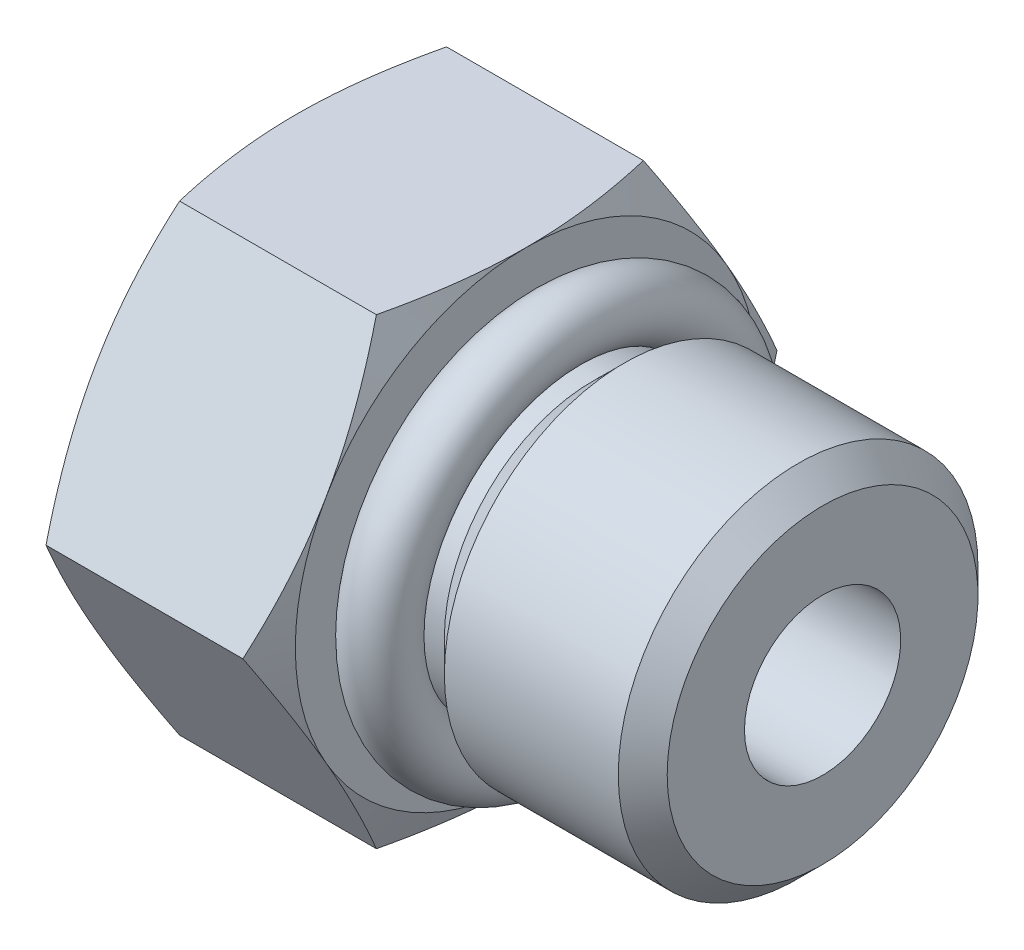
ISO-10303-21;
HEADER;
FILE_DESCRIPTION(('STEP AP214'),'2;1');
FILE_NAME('part.step','',(''),(''),'','','');
FILE_SCHEMA(('AUTOMOTIVE_DESIGN { 1 0 10303 214 1 1 1 1 }'));
ENDSEC;
DATA;
#1=APPLICATION_CONTEXT('core data for automotive mechanical design processes');
#2=APPLICATION_PROTOCOL_DEFINITION('international standard','automotive_design',2000,#1);
#3=PRODUCT_CONTEXT('',#1,'mechanical');
#4=PRODUCT('Part','Part','',(#3));
#5=PRODUCT_RELATED_PRODUCT_CATEGORY('part','',(#4));
#6=PRODUCT_DEFINITION_FORMATION('','',#4);
#7=PRODUCT_DEFINITION_CONTEXT('part definition',#1,'design');
#8=PRODUCT_DEFINITION('design','',#6,#7);
#9=PRODUCT_DEFINITION_SHAPE('','',#8);
#10=(LENGTH_UNIT() NAMED_UNIT(*) SI_UNIT(.MILLI.,.METRE.));
#11=(NAMED_UNIT(*) PLANE_ANGLE_UNIT() SI_UNIT($,.RADIAN.));
#12=(NAMED_UNIT(*) SI_UNIT($,.STERADIAN.) SOLID_ANGLE_UNIT());
#13=UNCERTAINTY_MEASURE_WITH_UNIT(LENGTH_MEASURE(1.E-05),#10,'distance_accuracy_value','');
#14=(GEOMETRIC_REPRESENTATION_CONTEXT(3) GLOBAL_UNCERTAINTY_ASSIGNED_CONTEXT((#13)) GLOBAL_UNIT_ASSIGNED_CONTEXT((#10,
#11,#12)) REPRESENTATION_CONTEXT('',''));
#15=CARTESIAN_POINT('',(0.,0.,0.));
#16=DIRECTION('',(0.,0.,1.));
#17=DIRECTION('',(1.,0.,0.));
#18=AXIS2_PLACEMENT_3D('',#15,#16,#17);
#19=CARTESIAN_POINT('',(-12.7,0.,0.));
#20=DIRECTION('',(-1.,0.,0.));
#21=DIRECTION('',(0.,0.,1.));
#22=AXIS2_PLACEMENT_3D('',#19,#20,#21);
#23=CYLINDRICAL_SURFACE('',#22,2.413);
#24=CARTESIAN_POINT('',(-6.53640795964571,0.,0.));
#25=DIRECTION('',(-1.,0.,0.));
#26=DIRECTION('',(0.,0.,1.));
#27=AXIS2_PLACEMENT_3D('',#24,#25,#26);
#28=CIRCLE('',#27,2.413);
#29=CARTESIAN_POINT('',(-6.53640795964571,0.,2.413));
#30=VERTEX_POINT('',#29);
#31=EDGE_CURVE('E44',#30,#30,#28,.T.);
#32=ORIENTED_EDGE('',*,*,#31,.T.);
#33=EDGE_LOOP('',(#32));
#34=FACE_BOUND('',#33,.T.);
#35=CARTESIAN_POINT('',(0.,0.,0.));
#36=DIRECTION('',(-1.,0.,0.));
#37=DIRECTION('',(0.,0.,1.));
#38=AXIS2_PLACEMENT_3D('',#35,#36,#37);
#39=CIRCLE('',#38,2.413);
#40=CARTESIAN_POINT('',(0.,0.,2.413));
#41=VERTEX_POINT('',#40);
#42=EDGE_CURVE('E306',#41,#41,#39,.T.);
#43=ORIENTED_EDGE('',*,*,#42,.F.);
#44=EDGE_LOOP('',(#43));
#45=FACE_BOUND('',#44,.T.);
#46=ADVANCED_FACE('F40',(#34,#45),#23,.F.);
#47=CARTESIAN_POINT('',(-16.256,0.,0.));
#48=DIRECTION('',(1.,0.,0.));
#49=DIRECTION('',(0.,1.,0.));
#50=AXIS2_PLACEMENT_3D('',#47,#48,#49);
#51=PLANE('',#50);
#52=CARTESIAN_POINT('',(-16.256,0.,0.));
#53=DIRECTION('',(-1.,0.,0.));
#54=DIRECTION('',(0.,0.,1.));
#55=AXIS2_PLACEMENT_3D('',#52,#53,#54);
#56=CIRCLE('',#55,4.7275369);
#57=CARTESIAN_POINT('',(-16.256,0.,4.7275369));
#58=VERTEX_POINT('',#57);
#59=EDGE_CURVE('E727',#58,#58,#56,.T.);
#60=ORIENTED_EDGE('',*,*,#59,.F.);
#61=EDGE_LOOP('',(#60));
#62=FACE_BOUND('',#61,.T.);
#63=CARTESIAN_POINT('',(-16.256,0.,0.));
#64=DIRECTION('',(1.,0.,0.));
#65=DIRECTION('',(0.,1.,0.));
#66=AXIS2_PLACEMENT_3D('',#63,#64,#65);
#67=CIRCLE('',#66,7.14375);
#68=CARTESIAN_POINT('',(-16.256,3.571875,6.18666897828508));
#69=VERTEX_POINT('',#68);
#70=CARTESIAN_POINT('',(-16.256,7.14375,0.));
#71=VERTEX_POINT('',#70);
#72=EDGE_CURVE('E132',#69,#71,#67,.F.);
#73=ORIENTED_EDGE('',*,*,#72,.T.);
#74=CARTESIAN_POINT('',(-16.256,0.,0.));
#75=DIRECTION('',(1.,0.,0.));
#76=DIRECTION('',(0.,1.,0.));
#77=AXIS2_PLACEMENT_3D('',#74,#75,#76);
#78=CIRCLE('',#77,7.14375);
#79=CARTESIAN_POINT('',(-16.256,3.571875,-6.18666897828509));
#80=VERTEX_POINT('',#79);
#81=EDGE_CURVE('E127',#71,#80,#78,.F.);
#82=ORIENTED_EDGE('',*,*,#81,.T.);
#83=CARTESIAN_POINT('',(-16.256,0.,0.));
#84=DIRECTION('',(1.,0.,0.));
#85=DIRECTION('',(0.,1.,0.));
#86=AXIS2_PLACEMENT_3D('',#83,#84,#85);
#87=CIRCLE('',#86,7.14375);
#88=CARTESIAN_POINT('',(-16.256,-3.57187500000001,-6.18666897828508));
#89=VERTEX_POINT('',#88);
#90=EDGE_CURVE('E129',#80,#89,#87,.F.);
#91=ORIENTED_EDGE('',*,*,#90,.T.);
#92=CARTESIAN_POINT('',(-16.256,0.,0.));
#93=DIRECTION('',(1.,0.,0.));
#94=DIRECTION('',(0.,1.,0.));
#95=AXIS2_PLACEMENT_3D('',#92,#93,#94);
#96=CIRCLE('',#95,7.14375);
#97=CARTESIAN_POINT('',(-16.256,-7.14375,0.));
#98=VERTEX_POINT('',#97);
#99=EDGE_CURVE('E313',#89,#98,#96,.F.);
#100=ORIENTED_EDGE('',*,*,#99,.T.);
#101=CARTESIAN_POINT('',(-16.256,0.,0.));
#102=DIRECTION('',(1.,0.,0.));
#103=DIRECTION('',(0.,1.,0.));
#104=AXIS2_PLACEMENT_3D('',#101,#102,#103);
#105=CIRCLE('',#104,7.14375);
#106=CARTESIAN_POINT('',(-16.256,-3.571875,6.18666897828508));
#107=VERTEX_POINT('',#106);
#108=EDGE_CURVE('E309',#98,#107,#105,.F.);
#109=ORIENTED_EDGE('',*,*,#108,.T.);
#110=CARTESIAN_POINT('',(-16.256,0.,0.));
#111=DIRECTION('',(1.,0.,0.));
#112=DIRECTION('',(0.,1.,0.));
#113=AXIS2_PLACEMENT_3D('',#110,#111,#112);
#114=CIRCLE('',#113,7.14375);
#115=EDGE_CURVE('E311',#107,#69,#114,.F.);
#116=ORIENTED_EDGE('',*,*,#115,.T.);
#117=EDGE_LOOP('',(#73,#82,#91,#100,#109,#116));
#118=FACE_BOUND('',#117,.T.);
#119=ADVANCED_FACE('F42',(#62,#118),#51,.F.);
#120=CARTESIAN_POINT('',(-16.256,0.,0.));
#121=DIRECTION('',(1.,0.,0.));
#122=DIRECTION('',(0.,1.,0.));
#123=AXIS2_PLACEMENT_3D('',#120,#121,#122);
#124=CONICAL_SURFACE('',#123,7.14375,1.13446401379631);
#125=ORIENTED_EDGE('',*,*,#90,.F.);
#126=CARTESIAN_POINT('',(-15.7406638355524,0.,-8.24889197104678));
#127=CARTESIAN_POINT('',(-15.8195905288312,0.293058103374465,-8.07969479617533));
#128=CARTESIAN_POINT('',(-15.8916199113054,0.58769517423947,-7.90958600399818));
#129=CARTESIAN_POINT('',(-16.0184120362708,1.17869518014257,-7.56837199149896));
#130=CARTESIAN_POINT('',(-16.0732320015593,1.47504898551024,-7.39727204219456));
#131=CARTESIAN_POINT('',(-16.1403575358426,1.92140845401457,-7.13956628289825));
#132=CARTESIAN_POINT('',(-16.1602205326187,2.0705634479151,-7.0534516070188));
#133=CARTESIAN_POINT('',(-16.1945639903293,2.36933901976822,-6.88095345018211));
#134=CARTESIAN_POINT('',(-16.2090445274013,2.51895959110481,-6.79456997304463));
#135=CARTESIAN_POINT('',(-16.2323806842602,2.81903318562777,-6.6213224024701));
#136=CARTESIAN_POINT('',(-16.2412173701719,2.96948732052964,-6.53445766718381));
#137=CARTESIAN_POINT('',(-16.2530376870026,3.27058454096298,-6.36061910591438));
#138=CARTESIAN_POINT('',(-16.2560206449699,3.42122764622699,-6.27364526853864));
#139=CARTESIAN_POINT('',(-16.256,3.571875,-6.18666897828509));
#140=B_SPLINE_CURVE_WITH_KNOTS('',3,(#126,#127,#128,#129,#130,#131,#132,#133,#134,#135,#136,
#137,#138,#139),.UNSPECIFIED.,.F.,.F.,(4,2,2,2,2,2,4),(0.,1.04269338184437,2.08188206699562,
2.60191814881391,3.12194687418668,3.64371114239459,4.16553538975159),.UNSPECIFIED.);
#141=CARTESIAN_POINT('',(-15.7406638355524,0.,-8.24889197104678));
#142=VERTEX_POINT('',#141);
#143=EDGE_CURVE('E143',#142,#80,#140,.T.);
#144=ORIENTED_EDGE('',*,*,#143,.F.);
#145=CARTESIAN_POINT('',(-16.256,-3.57187500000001,-6.18666897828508));
#146=CARTESIAN_POINT('',(-16.25602064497,-3.421227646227,-6.27364526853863));
#147=CARTESIAN_POINT('',(-16.2530376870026,-3.27058454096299,-6.36061910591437));
#148=CARTESIAN_POINT('',(-16.2412173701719,-2.96948732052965,-6.53445766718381));
#149=CARTESIAN_POINT('',(-16.2323806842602,-2.81903318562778,-6.62132240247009));
#150=CARTESIAN_POINT('',(-16.2090445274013,-2.51895959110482,-6.79456997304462));
#151=CARTESIAN_POINT('',(-16.1945639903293,-2.36933901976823,-6.88095345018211));
#152=CARTESIAN_POINT('',(-16.1602205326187,-2.07056344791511,-7.05345160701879));
#153=CARTESIAN_POINT('',(-16.1403575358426,-1.92140845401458,-7.13956628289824));
#154=CARTESIAN_POINT('',(-16.0732320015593,-1.47504898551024,-7.39727204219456));
#155=CARTESIAN_POINT('',(-16.0184120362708,-1.17869518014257,-7.56837199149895));
#156=CARTESIAN_POINT('',(-15.8916199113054,-0.587695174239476,-7.90958600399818));
#157=CARTESIAN_POINT('',(-15.8195905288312,-0.293058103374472,-8.07969479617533));
#158=CARTESIAN_POINT('',(-15.7406638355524,0.,-8.24889197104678));
#159=B_SPLINE_CURVE_WITH_KNOTS('',3,(#145,#146,#147,#148,#149,#150,#151,#152,#153,#154,#155,
#156,#157,#158),.UNSPECIFIED.,.F.,.F.,(4,2,2,2,2,2,4),(0.,0.521824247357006,1.04358851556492,
1.56361724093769,2.08365332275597,3.12284200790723,4.1655353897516),.UNSPECIFIED.);
#160=EDGE_CURVE('E145',#89,#142,#159,.T.);
#161=ORIENTED_EDGE('',*,*,#160,.F.);
#162=EDGE_LOOP('',(#125,#144,#161));
#163=FACE_BOUND('',#162,.T.);
#164=ADVANCED_FACE('F141',(#163),#124,.T.);
#165=CARTESIAN_POINT('',(-16.256,0.,0.));
#166=DIRECTION('',(1.,0.,0.));
#167=DIRECTION('',(0.,1.,0.));
#168=AXIS2_PLACEMENT_3D('',#165,#166,#167);
#169=CONICAL_SURFACE('',#168,7.14375,1.13446401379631);
#170=ORIENTED_EDGE('',*,*,#81,.F.);
#171=CARTESIAN_POINT('',(-15.7406638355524,7.14375,-4.12444598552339));
#172=CARTESIAN_POINT('',(-15.8195905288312,7.14375,-3.78605163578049));
#173=CARTESIAN_POINT('',(-15.8916199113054,7.14375,-3.44583405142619));
#174=CARTESIAN_POINT('',(-16.0184120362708,7.14375,-2.76340602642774));
#175=CARTESIAN_POINT('',(-16.0732320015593,7.14375,-2.42120612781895));
#176=CARTESIAN_POINT('',(-16.1403575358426,7.14375,-1.90579460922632));
#177=CARTESIAN_POINT('',(-16.1602205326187,7.14375,-1.73356525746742));
#178=CARTESIAN_POINT('',(-16.1945639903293,7.14375,-1.38856894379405));
#179=CARTESIAN_POINT('',(-16.2090445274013,7.14375,-1.21580198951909));
#180=CARTESIAN_POINT('',(-16.2323806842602,7.14375,-0.869306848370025));
#181=CARTESIAN_POINT('',(-16.2412173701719,7.14375,-0.695577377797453));
#182=CARTESIAN_POINT('',(-16.2530376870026,7.14375,-0.34790025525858));
#183=CARTESIAN_POINT('',(-16.25602064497,7.14375,-0.173952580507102));
#184=CARTESIAN_POINT('',(-16.256,7.14375,0.));
#185=B_SPLINE_CURVE_WITH_KNOTS('',3,(#171,#172,#173,#174,#175,#176,#177,#178,#179,#180,#181,
#182,#183,#184),.UNSPECIFIED.,.F.,.F.,(4,2,2,2,2,2,4),(0.,1.04269338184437,2.08188206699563,
2.60191814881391,3.12194687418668,3.64371114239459,4.1655353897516),.UNSPECIFIED.);
#186=CARTESIAN_POINT('',(-15.7406638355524,7.14375,-4.1244459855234));
#187=VERTEX_POINT('',#186);
#188=EDGE_CURVE('E150',#187,#71,#185,.T.);
#189=ORIENTED_EDGE('',*,*,#188,.F.);
#190=CARTESIAN_POINT('',(-16.256,3.571875,-6.18666897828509));
#191=CARTESIAN_POINT('',(-16.2560206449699,3.72252235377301,-6.09969268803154));
#192=CARTESIAN_POINT('',(-16.2530376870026,3.87316545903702,-6.0127188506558));
#193=CARTESIAN_POINT('',(-16.2412173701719,4.17426267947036,-5.83888028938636));
#194=CARTESIAN_POINT('',(-16.2323806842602,4.32471681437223,-5.75201555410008));
#195=CARTESIAN_POINT('',(-16.2090445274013,4.62479040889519,-5.57876798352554));
#196=CARTESIAN_POINT('',(-16.1945639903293,4.77441098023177,-5.49238450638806));
#197=CARTESIAN_POINT('',(-16.1602205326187,5.0731865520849,-5.31988634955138));
#198=CARTESIAN_POINT('',(-16.1403575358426,5.22234154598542,-5.23377167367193));
#199=CARTESIAN_POINT('',(-16.0732320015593,5.66870101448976,-4.97606591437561));
#200=CARTESIAN_POINT('',(-16.0184120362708,5.96505481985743,-4.80496596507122));
#201=CARTESIAN_POINT('',(-15.8916199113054,6.55605482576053,-4.463751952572));
#202=CARTESIAN_POINT('',(-15.8195905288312,6.85069189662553,-4.29364316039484));
#203=CARTESIAN_POINT('',(-15.7406638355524,7.14375,-4.1244459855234));
#204=B_SPLINE_CURVE_WITH_KNOTS('',3,(#190,#191,#192,#193,#194,#195,#196,#197,#198,#199,#200,
#201,#202,#203),.UNSPECIFIED.,.F.,.F.,(4,2,2,2,2,2,4),(0.,0.521824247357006,1.04358851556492,
1.56361724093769,2.08365332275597,3.12284200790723,4.16553538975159),.UNSPECIFIED.);
#205=EDGE_CURVE('E147',#80,#187,#204,.T.);
#206=ORIENTED_EDGE('',*,*,#205,.F.);
#207=EDGE_LOOP('',(#170,#189,#206));
#208=FACE_BOUND('',#207,.T.);
#209=ADVANCED_FACE('F148',(#208),#169,.T.);
#210=CARTESIAN_POINT('',(-16.256,0.,0.));
#211=DIRECTION('',(1.,0.,0.));
#212=DIRECTION('',(0.,1.,0.));
#213=AXIS2_PLACEMENT_3D('',#210,#211,#212);
#214=CONICAL_SURFACE('',#213,7.14375,1.13446401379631);
#215=ORIENTED_EDGE('',*,*,#72,.F.);
#216=CARTESIAN_POINT('',(-15.7406638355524,7.14375,4.12444598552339));
#217=CARTESIAN_POINT('',(-15.8195905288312,6.85069189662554,4.29364316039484));
#218=CARTESIAN_POINT('',(-15.8916199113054,6.55605482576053,4.46375195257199));
#219=CARTESIAN_POINT('',(-16.0184120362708,5.96505481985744,4.80496596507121));
#220=CARTESIAN_POINT('',(-16.0732320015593,5.66870101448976,4.97606591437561));
#221=CARTESIAN_POINT('',(-16.1403575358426,5.22234154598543,5.23377167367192));
#222=CARTESIAN_POINT('',(-16.1602205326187,5.0731865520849,5.31988634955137));
#223=CARTESIAN_POINT('',(-16.1945639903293,4.77441098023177,5.49238450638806));
#224=CARTESIAN_POINT('',(-16.2090445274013,4.62479040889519,5.57876798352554));
#225=CARTESIAN_POINT('',(-16.2323806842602,4.32471681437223,5.75201555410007));
#226=CARTESIAN_POINT('',(-16.2412173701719,4.17426267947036,5.83888028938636));
#227=CARTESIAN_POINT('',(-16.2530376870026,3.87316545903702,6.01271885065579));
#228=CARTESIAN_POINT('',(-16.2560206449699,3.72252235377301,6.09969268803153));
#229=CARTESIAN_POINT('',(-16.256,3.571875,6.18666897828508));
#230=B_SPLINE_CURVE_WITH_KNOTS('',3,(#216,#217,#218,#219,#220,#221,#222,#223,#224,#225,#226,
#227,#228,#229),.UNSPECIFIED.,.F.,.F.,(4,2,2,2,2,2,4),(0.,1.04269338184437,2.08188206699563,
2.60191814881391,3.12194687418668,3.64371114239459,4.1655353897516),.UNSPECIFIED.);
#231=CARTESIAN_POINT('',(-15.7406638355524,7.14375,4.12444598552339));
#232=VERTEX_POINT('',#231);
#233=EDGE_CURVE('E330',#232,#69,#230,.T.);
#234=ORIENTED_EDGE('',*,*,#233,.F.);
#235=CARTESIAN_POINT('',(-16.256,7.14375,0.));
#236=CARTESIAN_POINT('',(-16.2560206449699,7.14375,0.1739525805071));
#237=CARTESIAN_POINT('',(-16.2530376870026,7.14375,0.347900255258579));
#238=CARTESIAN_POINT('',(-16.2412173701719,7.14375,0.695577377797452));
#239=CARTESIAN_POINT('',(-16.2323806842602,7.14375,0.869306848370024));
#240=CARTESIAN_POINT('',(-16.2090445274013,7.14375,1.21580198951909));
#241=CARTESIAN_POINT('',(-16.1945639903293,7.14375,1.38856894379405));
#242=CARTESIAN_POINT('',(-16.1602205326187,7.14375,1.73356525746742));
#243=CARTESIAN_POINT('',(-16.1403575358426,7.14375,1.90579460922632));
#244=CARTESIAN_POINT('',(-16.0732320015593,7.14375,2.42120612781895));
#245=CARTESIAN_POINT('',(-16.0184120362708,7.14375,2.76340602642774));
#246=CARTESIAN_POINT('',(-15.8916199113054,7.14375,3.44583405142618));
#247=CARTESIAN_POINT('',(-15.8195905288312,7.14375,3.78605163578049));
#248=CARTESIAN_POINT('',(-15.7406638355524,7.14375,4.12444598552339));
#249=B_SPLINE_CURVE_WITH_KNOTS('',3,(#235,#236,#237,#238,#239,#240,#241,#242,#243,#244,#245,
#246,#247,#248),.UNSPECIFIED.,.F.,.F.,(4,2,2,2,2,2,4),(0.,0.521824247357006,1.04358851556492,
1.56361724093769,2.08365332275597,3.12284200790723,4.1655353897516),.UNSPECIFIED.);
#250=EDGE_CURVE('E344',#71,#232,#249,.T.);
#251=ORIENTED_EDGE('',*,*,#250,.F.);
#252=EDGE_LOOP('',(#215,#234,#251));
#253=FACE_BOUND('',#252,.T.);
#254=ADVANCED_FACE('F296',(#253),#214,.T.);
#255=CARTESIAN_POINT('',(-16.256,0.,0.));
#256=DIRECTION('',(1.,0.,0.));
#257=DIRECTION('',(0.,1.,0.));
#258=AXIS2_PLACEMENT_3D('',#255,#256,#257);
#259=CONICAL_SURFACE('',#258,7.14375,1.13446401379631);
#260=CARTESIAN_POINT('',(-16.256,-7.14375,0.));
#261=CARTESIAN_POINT('',(-16.25602064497,-7.14375,-0.1739525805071));
#262=CARTESIAN_POINT('',(-16.2530376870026,-7.14375,-0.347900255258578));
#263=CARTESIAN_POINT('',(-16.2412173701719,-7.14375,-0.695577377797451));
#264=CARTESIAN_POINT('',(-16.2323806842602,-7.14375,-0.869306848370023));
#265=CARTESIAN_POINT('',(-16.2090445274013,-7.14375,-1.21580198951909));
#266=CARTESIAN_POINT('',(-16.1945639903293,-7.14375,-1.38856894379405));
#267=CARTESIAN_POINT('',(-16.1602205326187,-7.14375,-1.73356525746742));
#268=CARTESIAN_POINT('',(-16.1403575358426,-7.14375,-1.90579460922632));
#269=CARTESIAN_POINT('',(-16.0732320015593,-7.14375,-2.42120612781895));
#270=CARTESIAN_POINT('',(-16.0184120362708,-7.14375,-2.76340602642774));
#271=CARTESIAN_POINT('',(-15.8916199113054,-7.14375,-3.44583405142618));
#272=CARTESIAN_POINT('',(-15.8195905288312,-7.14375,-3.78605163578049));
#273=CARTESIAN_POINT('',(-15.7406638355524,-7.14375,-4.12444598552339));
#274=B_SPLINE_CURVE_WITH_KNOTS('',3,(#260,#261,#262,#263,#264,#265,#266,#267,#268,#269,#270,
#271,#272,#273),.UNSPECIFIED.,.F.,.F.,(4,2,2,2,2,2,4),(0.,0.521824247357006,1.04358851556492,
1.56361724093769,2.08365332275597,3.12284200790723,4.1655353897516),.UNSPECIFIED.);
#275=CARTESIAN_POINT('',(-15.7406638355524,-7.14375,-4.12444598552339));
#276=VERTEX_POINT('',#275);
#277=EDGE_CURVE('E272',#98,#276,#274,.T.);
#278=ORIENTED_EDGE('',*,*,#277,.F.);
#279=ORIENTED_EDGE('',*,*,#99,.F.);
#280=CARTESIAN_POINT('',(-15.7406638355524,-7.14375,-4.12444598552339));
#281=CARTESIAN_POINT('',(-15.8195905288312,-6.85069189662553,-4.29364316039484));
#282=CARTESIAN_POINT('',(-15.8916199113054,-6.55605482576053,-4.46375195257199));
#283=CARTESIAN_POINT('',(-16.0184120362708,-5.96505481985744,-4.80496596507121));
#284=CARTESIAN_POINT('',(-16.0732320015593,-5.66870101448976,-4.97606591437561));
#285=CARTESIAN_POINT('',(-16.1403575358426,-5.22234154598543,-5.23377167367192));
#286=CARTESIAN_POINT('',(-16.1602205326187,-5.0731865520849,-5.31988634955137));
#287=CARTESIAN_POINT('',(-16.1945639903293,-4.77441098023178,-5.49238450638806));
#288=CARTESIAN_POINT('',(-16.2090445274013,-4.6247904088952,-5.57876798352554));
#289=CARTESIAN_POINT('',(-16.2323806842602,-4.32471681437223,-5.75201555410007));
#290=CARTESIAN_POINT('',(-16.2412173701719,-4.17426267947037,-5.83888028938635));
#291=CARTESIAN_POINT('',(-16.2530376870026,-3.87316545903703,-6.01271885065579));
#292=CARTESIAN_POINT('',(-16.25602064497,-3.72252235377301,-6.09969268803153));
#293=CARTESIAN_POINT('',(-16.256,-3.57187500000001,-6.18666897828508));
#294=B_SPLINE_CURVE_WITH_KNOTS('',3,(#280,#281,#282,#283,#284,#285,#286,#287,#288,#289,#290,
#291,#292,#293),.UNSPECIFIED.,.F.,.F.,(4,2,2,2,2,2,4),(0.,1.04269338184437,2.08188206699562,
2.6019181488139,3.12194687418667,3.64371114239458,4.16553538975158),.UNSPECIFIED.);
#295=EDGE_CURVE('E301',#276,#89,#294,.T.);
#296=ORIENTED_EDGE('',*,*,#295,.F.);
#297=EDGE_LOOP('',(#278,#279,#296));
#298=FACE_BOUND('',#297,.T.);
#299=ADVANCED_FACE('F291',(#298),#259,.T.);
#300=CARTESIAN_POINT('',(-16.256,0.,0.));
#301=DIRECTION('',(1.,0.,0.));
#302=DIRECTION('',(0.,1.,0.));
#303=AXIS2_PLACEMENT_3D('',#300,#301,#302);
#304=CONICAL_SURFACE('',#303,7.14375,1.13446401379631);
#305=ORIENTED_EDGE('',*,*,#115,.F.);
#306=CARTESIAN_POINT('',(-15.7406638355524,0.,8.24889197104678));
#307=CARTESIAN_POINT('',(-15.8195905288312,-0.293058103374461,8.07969479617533));
#308=CARTESIAN_POINT('',(-15.8916199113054,-0.587695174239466,7.90958600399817));
#309=CARTESIAN_POINT('',(-16.0184120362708,-1.17869518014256,7.56837199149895));
#310=CARTESIAN_POINT('',(-16.0732320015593,-1.47504898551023,7.39727204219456));
#311=CARTESIAN_POINT('',(-16.1403575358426,-1.92140845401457,7.13956628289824));
#312=CARTESIAN_POINT('',(-16.1602205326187,-2.0705634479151,7.05345160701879));
#313=CARTESIAN_POINT('',(-16.1945639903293,-2.36933901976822,6.88095345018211));
#314=CARTESIAN_POINT('',(-16.2090445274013,-2.51895959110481,6.79456997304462));
#315=CARTESIAN_POINT('',(-16.2323806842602,-2.81903318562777,6.62132240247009));
#316=CARTESIAN_POINT('',(-16.2412173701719,-2.96948732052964,6.53445766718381));
#317=CARTESIAN_POINT('',(-16.2530376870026,-3.27058454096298,6.36061910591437));
#318=CARTESIAN_POINT('',(-16.25602064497,-3.42122764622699,6.27364526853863));
#319=CARTESIAN_POINT('',(-16.256,-3.571875,6.18666897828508));
#320=B_SPLINE_CURVE_WITH_KNOTS('',3,(#306,#307,#308,#309,#310,#311,#312,#313,#314,#315,#316,
#317,#318,#319),.UNSPECIFIED.,.F.,.F.,(4,2,2,2,2,2,4),(0.,1.04269338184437,2.08188206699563,
2.60191814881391,3.12194687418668,3.64371114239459,4.1655353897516),.UNSPECIFIED.);
#321=CARTESIAN_POINT('',(-15.7406638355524,0.,8.24889197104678));
#322=VERTEX_POINT('',#321);
#323=EDGE_CURVE('E281',#322,#107,#320,.T.);
#324=ORIENTED_EDGE('',*,*,#323,.F.);
#325=CARTESIAN_POINT('',(-16.256,3.571875,6.18666897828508));
#326=CARTESIAN_POINT('',(-16.2560206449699,3.42122764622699,6.27364526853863));
#327=CARTESIAN_POINT('',(-16.2530376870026,3.27058454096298,6.36061910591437));
#328=CARTESIAN_POINT('',(-16.2412173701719,2.96948732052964,6.53445766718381));
#329=CARTESIAN_POINT('',(-16.2323806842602,2.81903318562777,6.62132240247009));
#330=CARTESIAN_POINT('',(-16.2090445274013,2.51895959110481,6.79456997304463));
#331=CARTESIAN_POINT('',(-16.1945639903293,2.36933901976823,6.88095345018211));
#332=CARTESIAN_POINT('',(-16.1602205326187,2.0705634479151,7.05345160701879));
#333=CARTESIAN_POINT('',(-16.1403575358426,1.92140845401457,7.13956628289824));
#334=CARTESIAN_POINT('',(-16.0732320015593,1.47504898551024,7.39727204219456));
#335=CARTESIAN_POINT('',(-16.0184120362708,1.17869518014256,7.56837199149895));
#336=CARTESIAN_POINT('',(-15.8916199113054,0.587695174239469,7.90958600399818));
#337=CARTESIAN_POINT('',(-15.8195905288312,0.293058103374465,8.07969479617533));
#338=CARTESIAN_POINT('',(-15.7406638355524,0.,8.24889197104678));
#339=B_SPLINE_CURVE_WITH_KNOTS('',3,(#325,#326,#327,#328,#329,#330,#331,#332,#333,#334,#335,
#336,#337,#338),.UNSPECIFIED.,.F.,.F.,(4,2,2,2,2,2,4),(0.,0.521824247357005,1.04358851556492,
1.56361724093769,2.08365332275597,3.12284200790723,4.1655353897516),.UNSPECIFIED.);
#340=EDGE_CURVE('E329',#69,#322,#339,.T.);
#341=ORIENTED_EDGE('',*,*,#340,.F.);
#342=EDGE_LOOP('',(#305,#324,#341));
#343=FACE_BOUND('',#342,.T.);
#344=ADVANCED_FACE('F295',(#343),#304,.T.);
#345=CARTESIAN_POINT('',(-16.256,0.,0.));
#346=DIRECTION('',(1.,0.,0.));
#347=DIRECTION('',(0.,1.,0.));
#348=AXIS2_PLACEMENT_3D('',#345,#346,#347);
#349=CONICAL_SURFACE('',#348,7.14375,1.13446401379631);
#350=CARTESIAN_POINT('',(-16.256,-3.571875,6.18666897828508));
#351=CARTESIAN_POINT('',(-16.25602064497,-3.72252235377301,6.09969268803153));
#352=CARTESIAN_POINT('',(-16.2530376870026,-3.87316545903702,6.01271885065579));
#353=CARTESIAN_POINT('',(-16.2412173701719,-4.17426267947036,5.83888028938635));
#354=CARTESIAN_POINT('',(-16.2323806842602,-4.32471681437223,5.75201555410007));
#355=CARTESIAN_POINT('',(-16.2090445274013,-4.62479040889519,5.57876798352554));
#356=CARTESIAN_POINT('',(-16.1945639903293,-4.77441098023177,5.49238450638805));
#357=CARTESIAN_POINT('',(-16.1602205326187,-5.0731865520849,5.31988634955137));
#358=CARTESIAN_POINT('',(-16.1403575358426,-5.22234154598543,5.23377167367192));
#359=CARTESIAN_POINT('',(-16.0732320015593,-5.66870101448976,4.9760659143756));
#360=CARTESIAN_POINT('',(-16.0184120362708,-5.96505481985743,4.80496596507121));
#361=CARTESIAN_POINT('',(-15.8916199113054,-6.55605482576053,4.46375195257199));
#362=CARTESIAN_POINT('',(-15.8195905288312,-6.85069189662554,4.29364316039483));
#363=CARTESIAN_POINT('',(-15.7406638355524,-7.14375,4.12444598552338));
#364=B_SPLINE_CURVE_WITH_KNOTS('',3,(#350,#351,#352,#353,#354,#355,#356,#357,#358,#359,#360,
#361,#362,#363),.UNSPECIFIED.,.F.,.F.,(4,2,2,2,2,2,4),(0.,0.521824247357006,1.04358851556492,
1.56361724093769,2.08365332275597,3.12284200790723,4.1655353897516),.UNSPECIFIED.);
#365=CARTESIAN_POINT('',(-15.7406638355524,-7.14374999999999,4.12444598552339));
#366=VERTEX_POINT('',#365);
#367=EDGE_CURVE('E324',#107,#366,#364,.T.);
#368=ORIENTED_EDGE('',*,*,#367,.F.);
#369=ORIENTED_EDGE('',*,*,#108,.F.);
#370=CARTESIAN_POINT('',(-15.7406638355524,-7.14374999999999,4.12444598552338));
#371=CARTESIAN_POINT('',(-15.8195905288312,-7.14374999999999,3.78605163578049));
#372=CARTESIAN_POINT('',(-15.8916199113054,-7.14374999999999,3.44583405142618));
#373=CARTESIAN_POINT('',(-16.0184120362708,-7.14374999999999,2.76340602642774));
#374=CARTESIAN_POINT('',(-16.0732320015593,-7.14374999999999,2.42120612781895));
#375=CARTESIAN_POINT('',(-16.1403575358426,-7.14374999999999,1.90579460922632));
#376=CARTESIAN_POINT('',(-16.1602205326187,-7.14374999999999,1.73356525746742));
#377=CARTESIAN_POINT('',(-16.1945639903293,-7.14374999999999,1.38856894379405));
#378=CARTESIAN_POINT('',(-16.2090445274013,-7.14375,1.21580198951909));
#379=CARTESIAN_POINT('',(-16.2323806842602,-7.14375,0.869306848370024));
#380=CARTESIAN_POINT('',(-16.2412173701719,-7.14375,0.695577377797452));
#381=CARTESIAN_POINT('',(-16.2530376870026,-7.14375,0.347900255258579));
#382=CARTESIAN_POINT('',(-16.25602064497,-7.14375,0.173952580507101));
#383=CARTESIAN_POINT('',(-16.256,-7.14375,0.));
#384=B_SPLINE_CURVE_WITH_KNOTS('',3,(#370,#371,#372,#373,#374,#375,#376,#377,#378,#379,#380,
#381,#382,#383),.UNSPECIFIED.,.F.,.F.,(4,2,2,2,2,2,4),(0.,1.04269338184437,2.08188206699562,
2.6019181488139,3.12194687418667,3.64371114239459,4.16553538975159),.UNSPECIFIED.);
#385=EDGE_CURVE('E280',#366,#98,#384,.T.);
#386=ORIENTED_EDGE('',*,*,#385,.F.);
#387=EDGE_LOOP('',(#368,#369,#386));
#388=FACE_BOUND('',#387,.T.);
#389=ADVANCED_FACE('F320',(#388),#349,.T.);
#390=CARTESIAN_POINT('',(0.,0.,-2.4003));
#391=DIRECTION('',(1.,0.,0.));
#392=DIRECTION('',(0.,1.,0.));
#393=AXIS2_PLACEMENT_3D('',#390,#391,#392);
#394=PLANE('',#393);
#395=CARTESIAN_POINT('',(0.,0.,0.));
#396=DIRECTION('',(-1.,0.,0.));
#397=DIRECTION('',(0.,0.,1.));
#398=AXIS2_PLACEMENT_3D('',#395,#396,#397);
#399=CIRCLE('',#398,4.80060000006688);
#400=CARTESIAN_POINT('',(0.,0.,4.80060000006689));
#401=VERTEX_POINT('',#400);
#402=EDGE_CURVE('E248',#401,#401,#399,.T.);
#403=ORIENTED_EDGE('',*,*,#402,.F.);
#404=EDGE_LOOP('',(#403));
#405=FACE_BOUND('',#404,.T.);
#406=ORIENTED_EDGE('',*,*,#42,.T.);
#407=EDGE_LOOP('',(#406));
#408=FACE_BOUND('',#407,.T.);
#409=ADVANCED_FACE('F493',(#405,#408),#394,.T.);
#410=CARTESIAN_POINT('',(-16.256,0.,-8.24889197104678));
#411=DIRECTION('',(0.,-0.500000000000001,-0.866025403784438));
#412=DIRECTION('',(0.,0.866025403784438,-0.500000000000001));
#413=AXIS2_PLACEMENT_3D('',#410,#411,#412);
#414=PLANE('',#413);
#415=ORIENTED_EDGE('',*,*,#160,.T.);
#416=DIRECTION('',(1.,0.,0.));
#417=VECTOR('',#416,1.);
#418=CARTESIAN_POINT('',(-16.256,0.,-8.24889197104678));
#419=LINE('',#418,#417);
#420=CARTESIAN_POINT('',(-9.659336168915,-1.65935959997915E-08,-8.2488919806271));
#421=VERTEX_POINT('',#420);
#422=EDGE_CURVE('E157',#421,#142,#419,.F.);
#423=ORIENTED_EDGE('',*,*,#422,.F.);
#424=CARTESIAN_POINT('',(-9.65933614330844,-7.85192756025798E-08,-8.24889192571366));
#425=CARTESIAN_POINT('',(-9.5804094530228,-0.293058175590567,-8.07969475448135));
#426=CARTESIAN_POINT('',(-9.50838007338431,-0.587695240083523,-7.9095859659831));
#427=CARTESIAN_POINT('',(-9.38158795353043,-1.17869523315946,-7.56837196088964));
#428=CARTESIAN_POINT('',(-9.32676799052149,-1.47504903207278,-7.39727201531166));
#429=CARTESIAN_POINT('',(-9.25964245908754,-1.92140849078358,-7.13956626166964));
#430=CARTESIAN_POINT('',(-9.23977946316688,-2.07056348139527,-7.05345158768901));
#431=CARTESIAN_POINT('',(-9.20543600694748,-2.36933904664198,-6.88095343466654));
#432=CARTESIAN_POINT('',(-9.1909554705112,-2.51895961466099,-6.79456995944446));
#433=CARTESIAN_POINT('',(-9.16761931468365,-2.81903320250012,-6.62132239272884));
#434=CARTESIAN_POINT('',(-9.15878262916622,-2.96948733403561,-6.53445765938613));
#435=CARTESIAN_POINT('',(-9.1469623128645,-3.27058454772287,-6.36061910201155));
#436=CARTESIAN_POINT('',(-9.14397935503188,-3.42122764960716,-6.27364526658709));
#437=CARTESIAN_POINT('',(-9.144,-3.571875,-6.18666897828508));
#438=B_SPLINE_CURVE_WITH_KNOTS('',3,(#424,#425,#426,#427,#428,#429,#430,#431,#432,#433,#434,
#435,#436,#437),.UNSPECIFIED.,.F.,.F.,(4,2,2,2,2,2,4),(0.,1.04269335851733,2.0818820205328,
2.60191809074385,3.12194680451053,3.64371106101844,4.16553529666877),.UNSPECIFIED.);
#439=CARTESIAN_POINT('',(-9.144,-3.571875,-6.18666897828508));
#440=VERTEX_POINT('',#439);
#441=EDGE_CURVE('E231',#421,#440,#438,.T.);
#442=ORIENTED_EDGE('',*,*,#441,.T.);
#443=CARTESIAN_POINT('',(-9.144,-3.571875,-6.18666897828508));
#444=CARTESIAN_POINT('',(-9.14397935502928,-3.72252235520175,-6.09969268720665));
#445=CARTESIAN_POINT('',(-9.14696231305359,-3.87316546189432,-6.01271884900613));
#446=CARTESIAN_POINT('',(-9.15878263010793,-4.17426268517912,-5.8388802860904));
#447=CARTESIAN_POINT('',(-9.16761931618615,-4.3247168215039,-5.7520155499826));
#448=CARTESIAN_POINT('',(-9.19095547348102,-4.62479041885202,-5.57876797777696));
#449=CARTESIAN_POINT('',(-9.2054360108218,-4.77441099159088,-5.49238449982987));
#450=CARTESIAN_POINT('',(-9.23977946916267,-5.07318656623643,-5.31988634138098));
#451=CARTESIAN_POINT('',(-9.2596424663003,-5.2223415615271,-5.23377166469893));
#452=CARTESIAN_POINT('',(-9.32676800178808,-5.66870103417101,-4.97606590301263));
#453=CARTESIAN_POINT('',(-9.38158796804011,-5.96505484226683,-4.80496595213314));
#454=CARTESIAN_POINT('',(-9.50838009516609,-6.55605485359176,-4.46375193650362));
#455=CARTESIAN_POINT('',(-9.58040947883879,-6.85069192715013,-4.29364314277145));
#456=CARTESIAN_POINT('',(-9.65933617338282,-7.14375003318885,-4.1244459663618));
#457=B_SPLINE_CURVE_WITH_KNOTS('',3,(#443,#444,#445,#446,#447,#448,#449,#450,#451,#452,#453,
#454,#455,#456),.UNSPECIFIED.,.F.,.F.,(4,2,2,2,2,2,4),(0.,0.52182425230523,1.04358852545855,
1.56361725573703,2.0836533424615,3.12284203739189,4.16553542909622),.UNSPECIFIED.);
#458=CARTESIAN_POINT('',(-9.65933616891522,-7.14375001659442,-4.12444597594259));
#459=VERTEX_POINT('',#458);
#460=EDGE_CURVE('E236',#440,#459,#457,.T.);
#461=ORIENTED_EDGE('',*,*,#460,.T.);
#462=DIRECTION('',(1.,0.,0.));
#463=VECTOR('',#462,1.);
#464=CARTESIAN_POINT('',(-16.256,-7.14375,-4.12444598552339));
#465=LINE('',#464,#463);
#466=EDGE_CURVE('E279',#276,#459,#465,.T.);
#467=ORIENTED_EDGE('',*,*,#466,.F.);
#468=ORIENTED_EDGE('',*,*,#295,.T.);
#469=EDGE_LOOP('',(#415,#423,#442,#461,#467,#468));
#470=FACE_BOUND('',#469,.T.);
#471=ADVANCED_FACE('F181',(#470),#414,.T.);
#472=CARTESIAN_POINT('',(-16.256,7.14375,-4.1244459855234));
#473=DIRECTION('',(0.,0.5,-0.866025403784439));
#474=DIRECTION('',(0.,0.866025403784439,0.5));
#475=AXIS2_PLACEMENT_3D('',#472,#473,#474);
#476=PLANE('',#475);
#477=ORIENTED_EDGE('',*,*,#205,.T.);
#478=DIRECTION('',(1.,0.,0.));
#479=VECTOR('',#478,1.);
#480=CARTESIAN_POINT('',(-16.256,7.14375,-4.1244459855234));
#481=LINE('',#480,#479);
#482=CARTESIAN_POINT('',(-9.65933615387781,7.14375,-4.1244459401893));
#483=VERTEX_POINT('',#482);
#484=EDGE_CURVE('E153',#483,#187,#481,.F.);
#485=ORIENTED_EDGE('',*,*,#484,.F.);
#486=CARTESIAN_POINT('',(-9.65933617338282,7.14375003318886,-4.1244459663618));
#487=CARTESIAN_POINT('',(-9.58040947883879,6.85069192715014,-4.29364314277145));
#488=CARTESIAN_POINT('',(-9.50838009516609,6.55605485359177,-4.46375193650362));
#489=CARTESIAN_POINT('',(-9.38158796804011,5.96505484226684,-4.80496595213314));
#490=CARTESIAN_POINT('',(-9.32676800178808,5.66870103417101,-4.97606590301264));
#491=CARTESIAN_POINT('',(-9.2596424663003,5.22234156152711,-5.23377166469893));
#492=CARTESIAN_POINT('',(-9.23977946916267,5.07318656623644,-5.31988634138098));
#493=CARTESIAN_POINT('',(-9.2054360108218,4.77441099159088,-5.49238449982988));
#494=CARTESIAN_POINT('',(-9.19095547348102,4.62479041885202,-5.57876797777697));
#495=CARTESIAN_POINT('',(-9.16761931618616,4.3247168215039,-5.7520155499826));
#496=CARTESIAN_POINT('',(-9.15878263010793,4.17426268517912,-5.83888028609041));
#497=CARTESIAN_POINT('',(-9.14696231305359,3.87316546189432,-6.01271884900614));
#498=CARTESIAN_POINT('',(-9.14397935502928,3.72252235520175,-6.09969268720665));
#499=CARTESIAN_POINT('',(-9.144,3.571875,-6.18666897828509));
#500=B_SPLINE_CURVE_WITH_KNOTS('',3,(#486,#487,#488,#489,#490,#491,#492,#493,#494,#495,#496,
#497,#498,#499),.UNSPECIFIED.,.F.,.F.,(4,2,2,2,2,2,4),(0.,1.04269339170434,2.08188208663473,
2.60191817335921,3.12194690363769,3.64371117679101,4.16553542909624),.UNSPECIFIED.);
#501=CARTESIAN_POINT('',(-9.144,3.571875,-6.18666897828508));
#502=VERTEX_POINT('',#501);
#503=EDGE_CURVE('E198',#483,#502,#500,.T.);
#504=ORIENTED_EDGE('',*,*,#503,.T.);
#505=CARTESIAN_POINT('',(-9.144,3.571875,-6.18666897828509));
#506=CARTESIAN_POINT('',(-9.14397935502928,3.42122764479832,-6.27364526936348));
#507=CARTESIAN_POINT('',(-9.14696231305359,3.27058453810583,-6.36061910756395));
#508=CARTESIAN_POINT('',(-9.15878263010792,2.96948731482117,-6.5344576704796));
#509=CARTESIAN_POINT('',(-9.16761931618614,2.81903317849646,-6.62132240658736));
#510=CARTESIAN_POINT('',(-9.19095547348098,2.51895958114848,-6.79456997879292));
#511=CARTESIAN_POINT('',(-9.20543601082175,2.36933900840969,-6.88095345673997));
#512=CARTESIAN_POINT('',(-9.23977946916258,2.07056343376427,-7.05345161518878));
#513=CARTESIAN_POINT('',(-9.25964246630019,1.92140843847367,-7.13956629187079));
#514=CARTESIAN_POINT('',(-9.32676800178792,1.47504896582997,-7.39727205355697));
#515=CARTESIAN_POINT('',(-9.3815879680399,1.17869515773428,-7.56837200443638));
#516=CARTESIAN_POINT('',(-9.50838009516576,0.587695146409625,-7.90958602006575));
#517=CARTESIAN_POINT('',(-9.5804094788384,0.293058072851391,-8.07969481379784));
#518=CARTESIAN_POINT('',(-9.65933617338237,-3.31871936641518E-08,-8.24889199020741));
#519=B_SPLINE_CURVE_WITH_KNOTS('',3,(#505,#506,#507,#508,#509,#510,#511,#512,#513,#514,#515,
#516,#517,#518),.UNSPECIFIED.,.F.,.F.,(4,2,2,2,2,2,4),(0.,0.521824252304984,1.04358852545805,
1.56361725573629,2.08365334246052,3.12284203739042,4.16553542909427),.UNSPECIFIED.);
#520=EDGE_CURVE('E189',#502,#421,#519,.T.);
#521=ORIENTED_EDGE('',*,*,#520,.T.);
#522=ORIENTED_EDGE('',*,*,#422,.T.);
#523=ORIENTED_EDGE('',*,*,#143,.T.);
#524=EDGE_LOOP('',(#477,#485,#504,#521,#522,#523));
#525=FACE_BOUND('',#524,.T.);
#526=ADVANCED_FACE('F155',(#525),#476,.T.);
#527=CARTESIAN_POINT('',(-16.256,7.14375,0.));
#528=DIRECTION('',(0.,1.,0.));
#529=DIRECTION('',(0.,0.,1.));
#530=AXIS2_PLACEMENT_3D('',#527,#528,#529);
#531=PLANE('',#530);
#532=DIRECTION('',(1.,0.,0.));
#533=VECTOR('',#532,1.);
#534=CARTESIAN_POINT('',(-16.256,7.14375,4.12444598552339));
#535=LINE('',#534,#533);
#536=CARTESIAN_POINT('',(-9.65933615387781,7.14374996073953,4.12444600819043));
#537=VERTEX_POINT('',#536);
#538=EDGE_CURVE('E335',#537,#232,#535,.F.);
#539=ORIENTED_EDGE('',*,*,#538,.F.);
#540=CARTESIAN_POINT('',(-9.65933617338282,7.14375,4.12444602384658));
#541=CARTESIAN_POINT('',(-9.58040947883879,7.14375,3.78605167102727));
#542=CARTESIAN_POINT('',(-9.50838009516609,7.14375,3.44583408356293));
#543=CARTESIAN_POINT('',(-9.38158796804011,7.14375,2.76340605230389));
#544=CARTESIAN_POINT('',(-9.32676800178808,7.14375,2.4212061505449));
#545=CARTESIAN_POINT('',(-9.2596424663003,7.14375,1.9057946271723));
#546=CARTESIAN_POINT('',(-9.23977946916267,7.14375,1.73356527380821));
#547=CARTESIAN_POINT('',(-9.2054360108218,7.14375,1.38856895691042));
#548=CARTESIAN_POINT('',(-9.19095547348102,7.14375,1.21580200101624));
#549=CARTESIAN_POINT('',(-9.16761931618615,7.14375,0.869306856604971));
#550=CARTESIAN_POINT('',(-9.15878263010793,7.14375,0.695577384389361));
#551=CARTESIAN_POINT('',(-9.14696231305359,7.14375,0.347900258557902));
#552=CARTESIAN_POINT('',(-9.14397935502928,7.14375,0.173952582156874));
#553=CARTESIAN_POINT('',(-9.144,7.14375,0.));
#554=B_SPLINE_CURVE_WITH_KNOTS('',3,(#540,#541,#542,#543,#544,#545,#546,#547,#548,#549,#550,
#551,#552,#553),.UNSPECIFIED.,.F.,.F.,(4,2,2,2,2,2,4),(0.,1.04269339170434,2.08188208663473,
2.6019181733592,3.12194690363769,3.643711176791,4.16553542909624),.UNSPECIFIED.);
#555=CARTESIAN_POINT('',(-9.144,7.14375,0.));
#556=VERTEX_POINT('',#555);
#557=EDGE_CURVE('E458',#537,#556,#554,.T.);
#558=ORIENTED_EDGE('',*,*,#557,.T.);
#559=CARTESIAN_POINT('',(-9.144,7.14375,0.));
#560=CARTESIAN_POINT('',(-9.14397935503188,7.14375,-0.173952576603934));
#561=CARTESIAN_POINT('',(-9.1469623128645,7.14375,-0.34790024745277));
#562=CARTESIAN_POINT('',(-9.15878262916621,7.14375,-0.695577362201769));
#563=CARTESIAN_POINT('',(-9.16761931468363,7.14375,-0.869306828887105));
#564=CARTESIAN_POINT('',(-9.19095547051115,7.14375,-1.21580196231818));
#565=CARTESIAN_POINT('',(-9.20543600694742,7.14375,-1.38856891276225));
#566=CARTESIAN_POINT('',(-9.2397794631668,7.14375,-1.73356521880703));
#567=CARTESIAN_POINT('',(-9.25964245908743,7.14375,-1.90579456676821));
#568=CARTESIAN_POINT('',(-9.32676799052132,7.14375,-2.42120607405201));
#569=CARTESIAN_POINT('',(-9.38158795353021,7.14375,-2.76340596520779));
#570=CARTESIAN_POINT('',(-9.50838007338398,7.14375,-3.4458339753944));
#571=CARTESIAN_POINT('',(-9.58040945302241,7.14375,-3.78605155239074));
#572=CARTESIAN_POINT('',(-9.65933614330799,7.14375,-4.1244458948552));
#573=B_SPLINE_CURVE_WITH_KNOTS('',3,(#559,#560,#561,#562,#563,#564,#565,#566,#567,#568,#569,
#570,#571,#572),.UNSPECIFIED.,.F.,.F.,(4,2,2,2,2,2,4),(0.,0.521824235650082,1.04358849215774,
1.56361720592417,2.08365327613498,3.12284193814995,4.16553529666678),.UNSPECIFIED.);
#574=EDGE_CURVE('E205',#556,#483,#573,.T.);
#575=ORIENTED_EDGE('',*,*,#574,.T.);
#576=ORIENTED_EDGE('',*,*,#484,.T.);
#577=ORIENTED_EDGE('',*,*,#188,.T.);
#578=ORIENTED_EDGE('',*,*,#250,.T.);
#579=EDGE_LOOP('',(#539,#558,#575,#576,#577,#578));
#580=FACE_BOUND('',#579,.T.);
#581=ADVANCED_FACE('F180',(#580),#531,.T.);
#582=CARTESIAN_POINT('',(-16.256,0.,8.24889197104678));
#583=DIRECTION('',(0.,0.5,0.866025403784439));
#584=DIRECTION('',(0.,-0.866025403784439,0.5));
#585=AXIS2_PLACEMENT_3D('',#582,#583,#584);
#586=PLANE('',#585);
#587=DIRECTION('',(1.,0.,0.));
#588=VECTOR('',#587,1.);
#589=CARTESIAN_POINT('',(-16.256,0.,8.24889197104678));
#590=LINE('',#589,#588);
#591=CARTESIAN_POINT('',(-9.6593361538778,-3.92604699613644E-08,8.24889194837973));
#592=VERTEX_POINT('',#591);
#593=EDGE_CURVE('E405',#592,#322,#590,.F.);
#594=ORIENTED_EDGE('',*,*,#593,.F.);
#595=CARTESIAN_POINT('',(-9.65933617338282,-3.31888543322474E-08,8.24889199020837));
#596=CARTESIAN_POINT('',(-9.58040947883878,0.293058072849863,8.07969481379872));
#597=CARTESIAN_POINT('',(-9.50838009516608,0.587695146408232,7.90958602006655));
#598=CARTESIAN_POINT('',(-9.38158796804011,1.17869515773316,7.56837200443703));
#599=CARTESIAN_POINT('',(-9.32676800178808,1.47504896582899,7.39727205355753));
#600=CARTESIAN_POINT('',(-9.2596424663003,1.92140843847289,7.13956629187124));
#601=CARTESIAN_POINT('',(-9.23977946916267,2.07056343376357,7.05345161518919));
#602=CARTESIAN_POINT('',(-9.2054360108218,2.36933900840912,6.88095345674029));
#603=CARTESIAN_POINT('',(-9.19095547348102,2.51895958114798,6.7945699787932));
#604=CARTESIAN_POINT('',(-9.16761931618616,2.8190331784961,6.62132240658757));
#605=CARTESIAN_POINT('',(-9.15878263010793,2.96948731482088,6.53445767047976));
#606=CARTESIAN_POINT('',(-9.14696231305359,3.27058453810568,6.36061910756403));
#607=CARTESIAN_POINT('',(-9.14397935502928,3.42122764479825,6.27364526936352));
#608=CARTESIAN_POINT('',(-9.144,3.571875,6.18666897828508));
#609=B_SPLINE_CURVE_WITH_KNOTS('',3,(#595,#596,#597,#598,#599,#600,#601,#602,#603,#604,#605,
#606,#607,#608),.UNSPECIFIED.,.F.,.F.,(4,2,2,2,2,2,4),(0.,1.04269339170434,2.08188208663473,
2.6019181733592,3.12194690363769,3.643711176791,4.16553542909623),.UNSPECIFIED.);
#610=CARTESIAN_POINT('',(-9.144,3.571875,6.18666897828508));
#611=VERTEX_POINT('',#610);
#612=EDGE_CURVE('E449',#592,#611,#609,.T.);
#613=ORIENTED_EDGE('',*,*,#612,.T.);
#614=CARTESIAN_POINT('',(-9.144,3.571875,6.18666897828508));
#615=CARTESIAN_POINT('',(-9.14397935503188,3.72252235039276,6.09969268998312));
#616=CARTESIAN_POINT('',(-9.14696231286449,3.87316545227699,6.0127188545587));
#617=CARTESIAN_POINT('',(-9.15878262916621,4.1742626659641,5.8388802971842));
#618=CARTESIAN_POINT('',(-9.16761931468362,4.32471679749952,5.75201556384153));
#619=CARTESIAN_POINT('',(-9.19095547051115,4.62479038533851,5.578767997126));
#620=CARTESIAN_POINT('',(-9.20543600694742,4.77441095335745,5.49238452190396));
#621=CARTESIAN_POINT('',(-9.23977946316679,5.07318651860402,5.31988636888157));
#622=CARTESIAN_POINT('',(-9.25964245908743,5.22234150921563,5.23377169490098));
#623=CARTESIAN_POINT('',(-9.32676799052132,5.66870096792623,4.97606594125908));
#624=CARTESIAN_POINT('',(-9.38158795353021,5.96505476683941,4.80496599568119));
#625=CARTESIAN_POINT('',(-9.50838007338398,6.55605475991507,4.46375199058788));
#626=CARTESIAN_POINT('',(-9.58040945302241,6.85069182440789,4.29364320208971));
#627=CARTESIAN_POINT('',(-9.65933614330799,7.14374992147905,4.12444603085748));
#628=B_SPLINE_CURVE_WITH_KNOTS('',3,(#614,#615,#616,#617,#618,#619,#620,#621,#622,#623,#624,
#625,#626,#627),.UNSPECIFIED.,.F.,.F.,(4,2,2,2,2,2,4),(0.,0.521824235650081,1.04358849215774,
1.56361720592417,2.08365327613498,3.12284193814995,4.16553529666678),.UNSPECIFIED.);
#629=EDGE_CURVE('E204',#611,#537,#628,.T.);
#630=ORIENTED_EDGE('',*,*,#629,.T.);
#631=ORIENTED_EDGE('',*,*,#538,.T.);
#632=ORIENTED_EDGE('',*,*,#233,.T.);
#633=ORIENTED_EDGE('',*,*,#340,.T.);
#634=EDGE_LOOP('',(#594,#613,#630,#631,#632,#633));
#635=FACE_BOUND('',#634,.T.);
#636=ADVANCED_FACE('F255',(#635),#586,.T.);
#637=CARTESIAN_POINT('',(-16.256,-7.14375,-4.12444598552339));
#638=DIRECTION('',(0.,-1.,0.));
#639=DIRECTION('',(0.,0.,-1.));
#640=AXIS2_PLACEMENT_3D('',#637,#638,#639);
#641=PLANE('',#640);
#642=ORIENTED_EDGE('',*,*,#277,.T.);
#643=ORIENTED_EDGE('',*,*,#466,.T.);
#644=CARTESIAN_POINT('',(-9.65933614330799,-7.14375,-4.12444589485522));
#645=CARTESIAN_POINT('',(-9.58040945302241,-7.14375,-3.78605155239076));
#646=CARTESIAN_POINT('',(-9.50838007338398,-7.14375,-3.44583397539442));
#647=CARTESIAN_POINT('',(-9.38158795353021,-7.14375,-2.76340596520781));
#648=CARTESIAN_POINT('',(-9.32676799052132,-7.14375,-2.42120607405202));
#649=CARTESIAN_POINT('',(-9.25964245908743,-7.14375,-1.90579456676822));
#650=CARTESIAN_POINT('',(-9.23977946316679,-7.14375,-1.73356521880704));
#651=CARTESIAN_POINT('',(-9.20543600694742,-7.14375,-1.38856891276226));
#652=CARTESIAN_POINT('',(-9.19095547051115,-7.14375,-1.21580196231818));
#653=CARTESIAN_POINT('',(-9.16761931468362,-7.14375,-0.86930682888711));
#654=CARTESIAN_POINT('',(-9.1587826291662,-7.14375,-0.695577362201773));
#655=CARTESIAN_POINT('',(-9.14696231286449,-7.14375,-0.347900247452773));
#656=CARTESIAN_POINT('',(-9.14397935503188,-7.14375,-0.173952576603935));
#657=CARTESIAN_POINT('',(-9.144,-7.14375,0.));
#658=B_SPLINE_CURVE_WITH_KNOTS('',3,(#644,#645,#646,#647,#648,#649,#650,#651,#652,#653,#654,
#655,#656,#657),.UNSPECIFIED.,.F.,.F.,(4,2,2,2,2,2,4),(0.,1.04269335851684,2.08188202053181,
2.60191809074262,3.12194680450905,3.64371106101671,4.1655352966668),.UNSPECIFIED.);
#659=CARTESIAN_POINT('',(-9.144,-7.14375,0.));
#660=VERTEX_POINT('',#659);
#661=EDGE_CURVE('E242',#459,#660,#658,.T.);
#662=ORIENTED_EDGE('',*,*,#661,.T.);
#663=CARTESIAN_POINT('',(-9.144,-7.14375,0.));
#664=CARTESIAN_POINT('',(-9.14397935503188,-7.14375,0.173952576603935));
#665=CARTESIAN_POINT('',(-9.14696231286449,-7.14375,0.347900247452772));
#666=CARTESIAN_POINT('',(-9.1587826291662,-7.14375,0.69557736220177));
#667=CARTESIAN_POINT('',(-9.16761931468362,-7.14375,0.869306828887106));
#668=CARTESIAN_POINT('',(-9.19095547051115,-7.14375,1.21580196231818));
#669=CARTESIAN_POINT('',(-9.20543600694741,-7.14374999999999,1.38856891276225));
#670=CARTESIAN_POINT('',(-9.23977946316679,-7.14374999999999,1.73356521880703));
#671=CARTESIAN_POINT('',(-9.25964245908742,-7.14374999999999,1.90579456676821));
#672=CARTESIAN_POINT('',(-9.32676799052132,-7.14374999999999,2.42120607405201));
#673=CARTESIAN_POINT('',(-9.3815879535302,-7.14374999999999,2.76340596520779));
#674=CARTESIAN_POINT('',(-9.50838007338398,-7.14374999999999,3.4458339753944));
#675=CARTESIAN_POINT('',(-9.5804094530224,-7.14374999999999,3.78605155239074));
#676=CARTESIAN_POINT('',(-9.65933614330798,-7.14374999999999,4.1244458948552));
#677=B_SPLINE_CURVE_WITH_KNOTS('',3,(#663,#664,#665,#666,#667,#668,#669,#670,#671,#672,#673,
#674,#675,#676),.UNSPECIFIED.,.F.,.F.,(4,2,2,2,2,2,4),(0.,0.521824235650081,1.04358849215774,
1.56361720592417,2.08365327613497,3.12284193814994,4.16553529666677),.UNSPECIFIED.);
#678=CARTESIAN_POINT('',(-9.6593361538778,-7.14374999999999,4.12444594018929));
#679=VERTEX_POINT('',#678);
#680=EDGE_CURVE('E262',#660,#679,#677,.T.);
#681=ORIENTED_EDGE('',*,*,#680,.T.);
#682=DIRECTION('',(1.,0.,0.));
#683=VECTOR('',#682,1.);
#684=CARTESIAN_POINT('',(-16.256,-7.14374999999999,4.12444598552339));
#685=LINE('',#684,#683);
#686=EDGE_CURVE('E328',#366,#679,#685,.T.);
#687=ORIENTED_EDGE('',*,*,#686,.F.);
#688=ORIENTED_EDGE('',*,*,#385,.T.);
#689=EDGE_LOOP('',(#642,#643,#662,#681,#687,#688));
#690=FACE_BOUND('',#689,.T.);
#691=ADVANCED_FACE('F250',(#690),#641,.T.);
#692=CARTESIAN_POINT('',(-16.256,-7.14375,4.12444598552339));
#693=DIRECTION('',(0.,-0.5,0.866025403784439));
#694=DIRECTION('',(0.,-0.866025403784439,-0.5));
#695=AXIS2_PLACEMENT_3D('',#692,#693,#694);
#696=PLANE('',#695);
#697=ORIENTED_EDGE('',*,*,#686,.T.);
#698=CARTESIAN_POINT('',(-9.65933617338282,-7.14375003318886,4.12444596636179));
#699=CARTESIAN_POINT('',(-9.58040947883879,-6.85069192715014,4.29364314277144));
#700=CARTESIAN_POINT('',(-9.50838009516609,-6.55605485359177,4.46375193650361));
#701=CARTESIAN_POINT('',(-9.38158796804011,-5.96505484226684,4.80496595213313));
#702=CARTESIAN_POINT('',(-9.32676800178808,-5.66870103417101,4.97606590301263));
#703=CARTESIAN_POINT('',(-9.2596424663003,-5.22234156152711,5.23377166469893));
#704=CARTESIAN_POINT('',(-9.23977946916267,-5.07318656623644,5.31988634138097));
#705=CARTESIAN_POINT('',(-9.2054360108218,-4.77441099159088,5.49238449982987));
#706=CARTESIAN_POINT('',(-9.19095547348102,-4.62479041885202,5.57876797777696));
#707=CARTESIAN_POINT('',(-9.16761931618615,-4.3247168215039,5.7520155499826));
#708=CARTESIAN_POINT('',(-9.15878263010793,-4.17426268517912,5.8388802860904));
#709=CARTESIAN_POINT('',(-9.14696231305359,-3.87316546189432,6.01271884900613));
#710=CARTESIAN_POINT('',(-9.14397935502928,-3.72252235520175,6.09969268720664));
#711=CARTESIAN_POINT('',(-9.144,-3.571875,6.18666897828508));
#712=B_SPLINE_CURVE_WITH_KNOTS('',3,(#698,#699,#700,#701,#702,#703,#704,#705,#706,#707,#708,
#709,#710,#711),.UNSPECIFIED.,.F.,.F.,(4,2,2,2,2,2,4),(0.,1.04269339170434,2.08188208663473,
2.60191817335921,3.12194690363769,3.64371117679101,4.16553542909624),.UNSPECIFIED.);
#713=CARTESIAN_POINT('',(-9.144,-3.571875,6.18666897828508));
#714=VERTEX_POINT('',#713);
#715=EDGE_CURVE('E59',#679,#714,#712,.T.);
#716=ORIENTED_EDGE('',*,*,#715,.T.);
#717=CARTESIAN_POINT('',(-9.144,-3.571875,6.18666897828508));
#718=CARTESIAN_POINT('',(-9.14397935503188,-3.42122764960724,6.27364526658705));
#719=CARTESIAN_POINT('',(-9.14696231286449,-3.27058454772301,6.36061910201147));
#720=CARTESIAN_POINT('',(-9.1587826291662,-2.9694873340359,6.53445765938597));
#721=CARTESIAN_POINT('',(-9.16761931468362,-2.81903320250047,6.62132239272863));
#722=CARTESIAN_POINT('',(-9.19095547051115,-2.51895961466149,6.79456995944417));
#723=CARTESIAN_POINT('',(-9.20543600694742,-2.36933904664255,6.88095343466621));
#724=CARTESIAN_POINT('',(-9.23977946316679,-2.07056348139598,7.0534515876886));
#725=CARTESIAN_POINT('',(-9.25964245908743,-1.92140849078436,7.13956626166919));
#726=CARTESIAN_POINT('',(-9.32676799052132,-1.47504903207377,7.39727201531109));
#727=CARTESIAN_POINT('',(-9.38158795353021,-1.17869523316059,7.56837196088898));
#728=CARTESIAN_POINT('',(-9.50838007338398,-0.587695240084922,7.90958596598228));
#729=CARTESIAN_POINT('',(-9.58040945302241,-0.293058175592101,8.07969475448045));
#730=CARTESIAN_POINT('',(-9.65933614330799,-7.85209445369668E-08,8.24889192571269));
#731=B_SPLINE_CURVE_WITH_KNOTS('',3,(#717,#718,#719,#720,#721,#722,#723,#724,#725,#726,#727,
#728,#729,#730),.UNSPECIFIED.,.F.,.F.,(4,2,2,2,2,2,4),(0.,0.521824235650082,1.04358849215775,
1.56361720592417,2.08365327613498,3.12284193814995,4.16553529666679),.UNSPECIFIED.);
#732=EDGE_CURVE('E454',#714,#592,#731,.T.);
#733=ORIENTED_EDGE('',*,*,#732,.T.);
#734=ORIENTED_EDGE('',*,*,#593,.T.);
#735=ORIENTED_EDGE('',*,*,#323,.T.);
#736=ORIENTED_EDGE('',*,*,#367,.T.);
#737=EDGE_LOOP('',(#697,#716,#733,#734,#735,#736));
#738=FACE_BOUND('',#737,.T.);
#739=ADVANCED_FACE('F254',(#738),#696,.T.);
#740=CARTESIAN_POINT('',(-0.755649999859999,0.,0.));
#741=DIRECTION('',(-1.,0.,0.));
#742=DIRECTION('',(0.,0.,1.));
#743=AXIS2_PLACEMENT_3D('',#740,#741,#742);
#744=CONICAL_SURFACE('',#743,5.55624999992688,0.785398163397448);
#745=ORIENTED_EDGE('',*,*,#402,.T.);
#746=EDGE_LOOP('',(#745));
#747=FACE_BOUND('',#746,.T.);
#748=CARTESIAN_POINT('',(-0.75565,0.,0.));
#749=DIRECTION('',(-1.,0.,0.));
#750=DIRECTION('',(0.,0.,1.));
#751=AXIS2_PLACEMENT_3D('',#748,#749,#750);
#752=CIRCLE('',#751,5.55625);
#753=CARTESIAN_POINT('',(-0.755650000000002,0.,5.55625));
#754=VERTEX_POINT('',#753);
#755=EDGE_CURVE('E412',#754,#754,#752,.T.);
#756=ORIENTED_EDGE('',*,*,#755,.F.);
#757=EDGE_LOOP('',(#756));
#758=FACE_BOUND('',#757,.T.);
#759=ADVANCED_FACE('F505',(#747,#758),#744,.T.);
#760=CARTESIAN_POINT('',(-9.144,0.,0.));
#761=DIRECTION('',(-1.,0.,0.));
#762=DIRECTION('',(0.,-1.,0.));
#763=AXIS2_PLACEMENT_3D('',#760,#761,#762);
#764=CONICAL_SURFACE('',#763,7.14375,1.13446401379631);
#765=CARTESIAN_POINT('',(-9.144,0.,0.));
#766=DIRECTION('',(-1.,0.,0.));
#767=DIRECTION('',(0.,-1.,0.));
#768=AXIS2_PLACEMENT_3D('',#765,#766,#767);
#769=CIRCLE('',#768,7.14375);
#770=EDGE_CURVE('E415',#660,#440,#769,.F.);
#771=ORIENTED_EDGE('',*,*,#770,.F.);
#772=ORIENTED_EDGE('',*,*,#661,.F.);
#773=ORIENTED_EDGE('',*,*,#460,.F.);
#774=EDGE_LOOP('',(#771,#772,#773));
#775=FACE_BOUND('',#774,.T.);
#776=ADVANCED_FACE('F226',(#775),#764,.T.);
#777=CARTESIAN_POINT('',(-9.144,0.,0.));
#778=DIRECTION('',(-1.,0.,0.));
#779=DIRECTION('',(0.,-1.,0.));
#780=AXIS2_PLACEMENT_3D('',#777,#778,#779);
#781=CONICAL_SURFACE('',#780,7.14375,1.13446401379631);
#782=CARTESIAN_POINT('',(-9.144,0.,0.));
#783=DIRECTION('',(-1.,0.,0.));
#784=DIRECTION('',(0.,-1.,0.));
#785=AXIS2_PLACEMENT_3D('',#782,#783,#784);
#786=CIRCLE('',#785,7.14375);
#787=EDGE_CURVE('E429',#440,#502,#786,.F.);
#788=ORIENTED_EDGE('',*,*,#787,.F.);
#789=ORIENTED_EDGE('',*,*,#441,.F.);
#790=ORIENTED_EDGE('',*,*,#520,.F.);
#791=EDGE_LOOP('',(#788,#789,#790));
#792=FACE_BOUND('',#791,.T.);
#793=ADVANCED_FACE('F218',(#792),#781,.T.);
#794=CARTESIAN_POINT('',(-9.144,0.,0.));
#795=DIRECTION('',(-1.,0.,0.));
#796=DIRECTION('',(0.,-1.,0.));
#797=AXIS2_PLACEMENT_3D('',#794,#795,#796);
#798=CONICAL_SURFACE('',#797,7.14375,1.13446401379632);
#799=ORIENTED_EDGE('',*,*,#574,.F.);
#800=CARTESIAN_POINT('',(-9.144,0.,0.));
#801=DIRECTION('',(-1.,0.,0.));
#802=DIRECTION('',(0.,-1.,0.));
#803=AXIS2_PLACEMENT_3D('',#800,#801,#802);
#804=CIRCLE('',#803,7.14375);
#805=EDGE_CURVE('E426',#502,#556,#804,.F.);
#806=ORIENTED_EDGE('',*,*,#805,.F.);
#807=ORIENTED_EDGE('',*,*,#503,.F.);
#808=EDGE_LOOP('',(#799,#806,#807));
#809=FACE_BOUND('',#808,.T.);
#810=ADVANCED_FACE('F214',(#809),#798,.T.);
#811=CARTESIAN_POINT('',(-9.144,0.,0.));
#812=DIRECTION('',(-1.,0.,0.));
#813=DIRECTION('',(0.,-1.,0.));
#814=AXIS2_PLACEMENT_3D('',#811,#812,#813);
#815=CONICAL_SURFACE('',#814,7.14375,1.13446401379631);
#816=ORIENTED_EDGE('',*,*,#629,.F.);
#817=CARTESIAN_POINT('',(-9.144,0.,0.));
#818=DIRECTION('',(-1.,0.,0.));
#819=DIRECTION('',(0.,-1.,0.));
#820=AXIS2_PLACEMENT_3D('',#817,#818,#819);
#821=CIRCLE('',#820,7.14375);
#822=EDGE_CURVE('E423',#556,#611,#821,.F.);
#823=ORIENTED_EDGE('',*,*,#822,.F.);
#824=ORIENTED_EDGE('',*,*,#557,.F.);
#825=EDGE_LOOP('',(#816,#823,#824));
#826=FACE_BOUND('',#825,.T.);
#827=ADVANCED_FACE('F217',(#826),#815,.T.);
#828=CARTESIAN_POINT('',(-9.144,0.,0.));
#829=DIRECTION('',(-1.,0.,0.));
#830=DIRECTION('',(0.,-1.,0.));
#831=AXIS2_PLACEMENT_3D('',#828,#829,#830);
#832=CONICAL_SURFACE('',#831,7.14375,1.13446401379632);
#833=ORIENTED_EDGE('',*,*,#732,.F.);
#834=CARTESIAN_POINT('',(-9.144,0.,0.));
#835=DIRECTION('',(-1.,0.,0.));
#836=DIRECTION('',(0.,-1.,0.));
#837=AXIS2_PLACEMENT_3D('',#834,#835,#836);
#838=CIRCLE('',#837,7.14375);
#839=EDGE_CURVE('E420',#611,#714,#838,.F.);
#840=ORIENTED_EDGE('',*,*,#839,.F.);
#841=ORIENTED_EDGE('',*,*,#612,.F.);
#842=EDGE_LOOP('',(#833,#840,#841));
#843=FACE_BOUND('',#842,.T.);
#844=ADVANCED_FACE('F441',(#843),#832,.T.);
#845=CARTESIAN_POINT('',(-9.144,0.,0.));
#846=DIRECTION('',(-1.,0.,0.));
#847=DIRECTION('',(0.,-1.,0.));
#848=AXIS2_PLACEMENT_3D('',#845,#846,#847);
#849=CONICAL_SURFACE('',#848,7.14375,1.13446401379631);
#850=ORIENTED_EDGE('',*,*,#680,.F.);
#851=CARTESIAN_POINT('',(-9.144,0.,0.));
#852=DIRECTION('',(-1.,0.,0.));
#853=DIRECTION('',(0.,-1.,0.));
#854=AXIS2_PLACEMENT_3D('',#851,#852,#853);
#855=CIRCLE('',#854,7.14375);
#856=EDGE_CURVE('E399',#714,#660,#855,.F.);
#857=ORIENTED_EDGE('',*,*,#856,.F.);
#858=ORIENTED_EDGE('',*,*,#715,.F.);
#859=EDGE_LOOP('',(#850,#857,#858));
#860=FACE_BOUND('',#859,.T.);
#861=ADVANCED_FACE('F436',(#860),#849,.T.);
#862=CARTESIAN_POINT('',(-3.4417,0.,0.));
#863=DIRECTION('',(-1.,0.,0.));
#864=DIRECTION('',(0.,0.,1.));
#865=AXIS2_PLACEMENT_3D('',#862,#863,#864);
#866=CYLINDRICAL_SURFACE('',#865,5.55625);
#867=ORIENTED_EDGE('',*,*,#755,.T.);
#868=EDGE_LOOP('',(#867));
#869=FACE_BOUND('',#868,.T.);
#870=CARTESIAN_POINT('',(-6.12775000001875,0.,0.));
#871=DIRECTION('',(1.,0.,0.));
#872=DIRECTION('',(0.,0.,-1.));
#873=AXIS2_PLACEMENT_3D('',#870,#871,#872);
#874=CIRCLE('',#873,5.55625000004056);
#875=CARTESIAN_POINT('',(-6.12775000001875,0.,-5.55625000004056));
#876=VERTEX_POINT('',#875);
#877=EDGE_CURVE('E396',#876,#876,#874,.F.);
#878=ORIENTED_EDGE('',*,*,#877,.F.);
#879=EDGE_LOOP('',(#878));
#880=FACE_BOUND('',#879,.T.);
#881=ADVANCED_FACE('F440',(#869,#880),#866,.T.);
#882=CARTESIAN_POINT('',(-9.144,0.,0.));
#883=DIRECTION('',(1.,0.,0.));
#884=DIRECTION('',(0.,1.,0.));
#885=AXIS2_PLACEMENT_3D('',#882,#883,#884);
#886=PLANE('',#885);
#887=ORIENTED_EDGE('',*,*,#839,.T.);
#888=ORIENTED_EDGE('',*,*,#856,.T.);
#889=ORIENTED_EDGE('',*,*,#770,.T.);
#890=ORIENTED_EDGE('',*,*,#787,.T.);
#891=ORIENTED_EDGE('',*,*,#805,.T.);
#892=ORIENTED_EDGE('',*,*,#822,.T.);
#893=EDGE_LOOP('',(#887,#888,#889,#890,#891,#892));
#894=FACE_BOUND('',#893,.T.);
#895=CARTESIAN_POINT('',(-9.144,0.,0.));
#896=DIRECTION('',(-1.,0.,0.));
#897=DIRECTION('',(0.,0.,1.));
#898=AXIS2_PLACEMENT_3D('',#895,#896,#897);
#899=CIRCLE('',#898,4.572);
#900=CARTESIAN_POINT('',(-9.144,0.,4.572));
#901=VERTEX_POINT('',#900);
#902=EDGE_CURVE('E395',#901,#901,#899,.F.);
#903=ORIENTED_EDGE('',*,*,#902,.F.);
#904=EDGE_LOOP('',(#903));
#905=FACE_BOUND('',#904,.T.);
#906=ADVANCED_FACE('F474',(#894,#905),#886,.T.);
#907=CARTESIAN_POINT('',(-6.12775000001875,0.,0.));
#908=DIRECTION('',(1.,0.,0.));
#909=DIRECTION('',(0.,0.,-1.));
#910=AXIS2_PLACEMENT_3D('',#907,#908,#909);
#911=CONICAL_SURFACE('',#910,5.55625000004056,0.785398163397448);
#912=ORIENTED_EDGE('',*,*,#877,.T.);
#913=EDGE_LOOP('',(#912));
#914=FACE_BOUND('',#913,.T.);
#915=CARTESIAN_POINT('',(-7.112,0.,0.));
#916=DIRECTION('',(-1.,0.,0.));
#917=DIRECTION('',(0.,0.,1.));
#918=AXIS2_PLACEMENT_3D('',#915,#916,#917);
#919=CIRCLE('',#918,4.572);
#920=CARTESIAN_POINT('',(-7.112,0.,4.572));
#921=VERTEX_POINT('',#920);
#922=EDGE_CURVE('E392',#921,#921,#919,.T.);
#923=ORIENTED_EDGE('',*,*,#922,.F.);
#924=EDGE_LOOP('',(#923));
#925=FACE_BOUND('',#924,.T.);
#926=ADVANCED_FACE('F514',(#914,#925),#911,.T.);
#927=CARTESIAN_POINT('',(-8.128,0.,0.));
#928=DIRECTION('',(-1.,0.,0.));
#929=DIRECTION('',(0.,0.,1.));
#930=AXIS2_PLACEMENT_3D('',#927,#928,#929);
#931=CYLINDRICAL_SURFACE('',#930,4.572);
#932=ORIENTED_EDGE('',*,*,#902,.T.);
#933=EDGE_LOOP('',(#932));
#934=FACE_BOUND('',#933,.T.);
#935=CARTESIAN_POINT('',(-8.30946021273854,0.,0.));
#936=DIRECTION('',(1.,0.,0.));
#937=DIRECTION('',(0.,0.,-1.));
#938=AXIS2_PLACEMENT_3D('',#935,#936,#937);
#939=CIRCLE('',#938,4.572);
#940=CARTESIAN_POINT('',(-8.30946021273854,0.,-4.572));
#941=VERTEX_POINT('',#940);
#942=EDGE_CURVE('E50',#941,#941,#939,.T.);
#943=ORIENTED_EDGE('',*,*,#942,.F.);
#944=EDGE_LOOP('',(#943));
#945=FACE_BOUND('',#944,.T.);
#946=ADVANCED_FACE('F380',(#934,#945),#931,.T.);
#947=CARTESIAN_POINT('',(-8.128,0.,0.));
#948=DIRECTION('',(-1.,0.,0.));
#949=DIRECTION('',(0.,0.,1.));
#950=AXIS2_PLACEMENT_3D('',#947,#948,#949);
#951=CYLINDRICAL_SURFACE('',#950,4.572);
#952=ORIENTED_EDGE('',*,*,#922,.T.);
#953=EDGE_LOOP('',(#952));
#954=FACE_BOUND('',#953,.T.);
#955=CARTESIAN_POINT('',(-7.99733978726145,0.,0.));
#956=DIRECTION('',(1.,0.,0.));
#957=DIRECTION('',(0.,0.,-1.));
#958=AXIS2_PLACEMENT_3D('',#955,#956,#957);
#959=CIRCLE('',#958,4.572);
#960=CARTESIAN_POINT('',(-7.99733978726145,0.,-4.572));
#961=VERTEX_POINT('',#960);
#962=EDGE_CURVE('E11',#961,#961,#959,.F.);
#963=ORIENTED_EDGE('',*,*,#962,.F.);
#964=EDGE_LOOP('',(#963));
#965=FACE_BOUND('',#964,.T.);
#966=ADVANCED_FACE('F370',(#954,#965),#951,.T.);
#967=CARTESIAN_POINT('',(-8.1534,0.,0.));
#968=DIRECTION('',(1.,0.,0.));
#969=DIRECTION('',(0.,0.,-1.));
#970=AXIS2_PLACEMENT_3D('',#967,#968,#969);
#971=TOROIDAL_SURFACE('',#970,5.5245,0.9652);
#972=ORIENTED_EDGE('',*,*,#962,.T.);
#973=EDGE_LOOP('',(#972));
#974=FACE_BOUND('',#973,.T.);
#975=ORIENTED_EDGE('',*,*,#942,.T.);
#976=EDGE_LOOP('',(#975));
#977=FACE_BOUND('',#976,.T.);
#978=ADVANCED_FACE('F361',(#974,#977),#971,.T.);
#979=CARTESIAN_POINT('',(-7.62000000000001,0.,0.));
#980=DIRECTION('',(-1.,0.,0.));
#981=DIRECTION('',(0.,0.,1.));
#982=AXIS2_PLACEMENT_3D('',#979,#980,#981);
#983=CONICAL_SURFACE('',#982,4.21640000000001,1.02974425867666);
#984=CARTESIAN_POINT('',(-7.62000000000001,0.,0.));
#985=DIRECTION('',(-1.,0.,0.));
#986=DIRECTION('',(0.,0.,1.));
#987=AXIS2_PLACEMENT_3D('',#984,#985,#986);
#988=CIRCLE('',#987,4.21640000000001);
#989=CARTESIAN_POINT('',(-7.62000000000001,0.,4.21640000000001));
#990=VERTEX_POINT('',#989);
#991=EDGE_CURVE('E389',#990,#990,#988,.T.);
#992=ORIENTED_EDGE('',*,*,#991,.T.);
#993=EDGE_LOOP('',(#992));
#994=FACE_BOUND('',#993,.T.);
#995=ORIENTED_EDGE('',*,*,#31,.F.);
#996=EDGE_LOOP('',(#995));
#997=FACE_BOUND('',#996,.T.);
#998=ADVANCED_FACE('F366',(#994,#997),#983,.F.);
#999=CARTESIAN_POINT('',(-16.256,0.,0.));
#1000=DIRECTION('',(-1.,0.,0.));
#1001=DIRECTION('',(0.,0.,1.));
#1002=AXIS2_PLACEMENT_3D('',#999,#1000,#1001);
#1003=CYLINDRICAL_SURFACE('',#1002,4.21640000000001);
#1004=ORIENTED_EDGE('',*,*,#991,.F.);
#1005=EDGE_LOOP('',(#1004));
#1006=FACE_BOUND('',#1005,.T.);
#1007=CARTESIAN_POINT('',(-9.90600000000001,0.,0.));
#1008=DIRECTION('',(-1.,0.,0.));
#1009=DIRECTION('',(0.,0.,1.));
#1010=AXIS2_PLACEMENT_3D('',#1007,#1008,#1009);
#1011=CIRCLE('',#1010,4.2164);
#1012=CARTESIAN_POINT('',(-9.90600000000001,0.,4.2164));
#1013=VERTEX_POINT('',#1012);
#1014=EDGE_CURVE('E729',#1013,#1013,#1011,.T.);
#1015=ORIENTED_EDGE('',*,*,#1014,.T.);
#1016=EDGE_LOOP('',(#1015));
#1017=FACE_BOUND('',#1016,.T.);
#1018=ADVANCED_FACE('F377',(#1006,#1017),#1003,.F.);
#1019=CARTESIAN_POINT('',(-9.90600000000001,4.2164,0.));
#1020=DIRECTION('',(1.,0.,0.));
#1021=DIRECTION('',(0.,0.,-1.));
#1022=AXIS2_PLACEMENT_3D('',#1019,#1020,#1021);
#1023=PLANE('',#1022);
#1024=ORIENTED_EDGE('',*,*,#1014,.F.);
#1025=EDGE_LOOP('',(#1024));
#1026=FACE_BOUND('',#1025,.T.);
#1027=CARTESIAN_POINT('',(-9.90600000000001,0.,0.));
#1028=DIRECTION('',(-1.,0.,0.));
#1029=DIRECTION('',(0.,0.,1.));
#1030=AXIS2_PLACEMENT_3D('',#1027,#1028,#1029);
#1031=CIRCLE('',#1030,4.53740939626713);
#1032=CARTESIAN_POINT('',(-9.90600000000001,0.,4.53740939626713));
#1033=VERTEX_POINT('',#1032);
#1034=EDGE_CURVE('E724',#1033,#1033,#1031,.T.);
#1035=ORIENTED_EDGE('',*,*,#1034,.T.);
#1036=EDGE_LOOP('',(#1035));
#1037=FACE_BOUND('',#1036,.T.);
#1038=ADVANCED_FACE('F674',(#1026,#1037),#1023,.F.);
#1039=CARTESIAN_POINT('',(-16.256,0.,0.));
#1040=DIRECTION('',(-1.,0.,0.));
#1041=DIRECTION('',(0.,0.,1.));
#1042=AXIS2_PLACEMENT_3D('',#1039,#1040,#1041);
#1043=CONICAL_SURFACE('',#1042,4.7275369,0.0299323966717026);
#1044=ORIENTED_EDGE('',*,*,#1034,.F.);
#1045=EDGE_LOOP('',(#1044));
#1046=FACE_BOUND('',#1045,.T.);
#1047=ORIENTED_EDGE('',*,*,#59,.T.);
#1048=EDGE_LOOP('',(#1047));
#1049=FACE_BOUND('',#1048,.T.);
#1050=ADVANCED_FACE('F683',(#1046,#1049),#1043,.F.);
#1051=CLOSED_SHELL('',(#46,#119,#164,#209,#254,#299,#344,#389,#409,#471,#526,#581,#636,#691,
#739,#759,#776,#793,#810,#827,#844,#861,#881,#906,#926,#946,#966,#978,#998,#1018,#1038,#1050));
#1052=MANIFOLD_SOLID_BREP('B2',#1051);
#1053=ADVANCED_BREP_SHAPE_REPRESENTATION('',(#18,#1052),#14);
#1054=SHAPE_DEFINITION_REPRESENTATION(#9,#1053);
ENDSEC;
END-ISO-10303-21;
